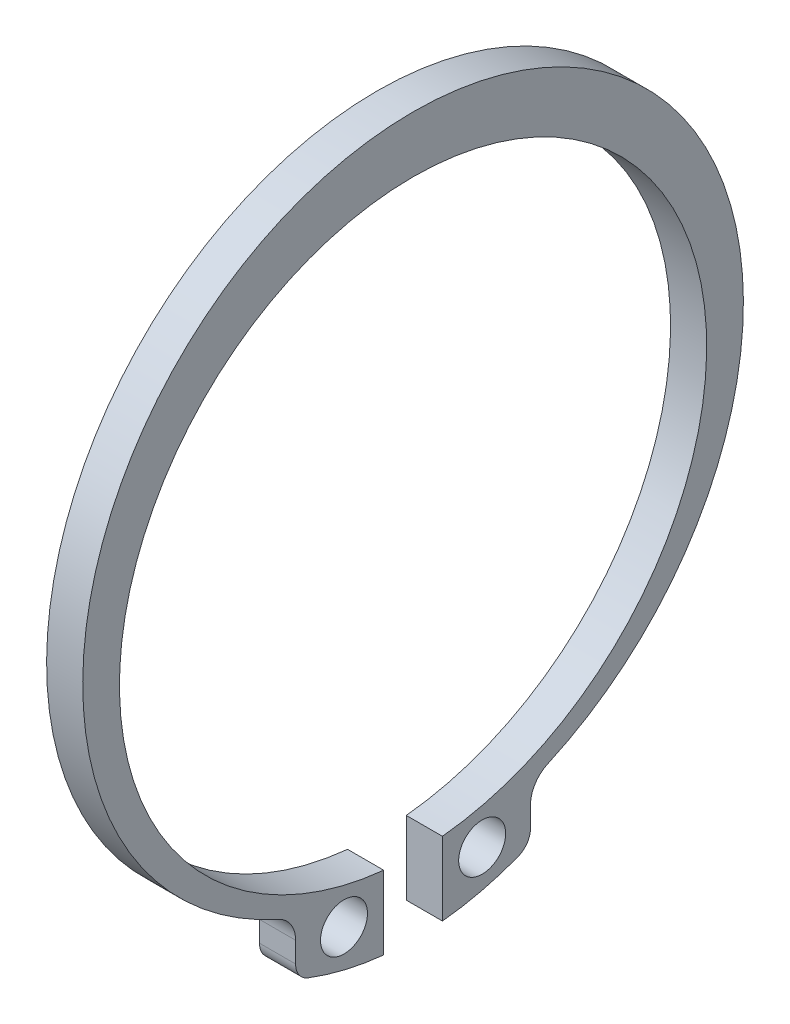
ISO-10303-21;
HEADER;
FILE_DESCRIPTION(('STEP AP214'),'2;1');
FILE_NAME('part.step','',(''),(''),'','','');
FILE_SCHEMA(('AUTOMOTIVE_DESIGN { 1 0 10303 214 1 1 1 1 }'));
ENDSEC;
DATA;
#1=APPLICATION_CONTEXT('core data for automotive mechanical design processes');
#2=APPLICATION_PROTOCOL_DEFINITION('international standard','automotive_design',2000,#1);
#3=PRODUCT_CONTEXT('',#1,'mechanical');
#4=PRODUCT('Part','Part','',(#3));
#5=PRODUCT_RELATED_PRODUCT_CATEGORY('part','',(#4));
#6=PRODUCT_DEFINITION_FORMATION('','',#4);
#7=PRODUCT_DEFINITION_CONTEXT('part definition',#1,'design');
#8=PRODUCT_DEFINITION('design','',#6,#7);
#9=PRODUCT_DEFINITION_SHAPE('','',#8);
#10=(LENGTH_UNIT() NAMED_UNIT(*) SI_UNIT(.MILLI.,.METRE.));
#11=(NAMED_UNIT(*) PLANE_ANGLE_UNIT() SI_UNIT($,.RADIAN.));
#12=(NAMED_UNIT(*) SI_UNIT($,.STERADIAN.) SOLID_ANGLE_UNIT());
#13=UNCERTAINTY_MEASURE_WITH_UNIT(LENGTH_MEASURE(1.E-05),#10,'distance_accuracy_value','');
#14=(GEOMETRIC_REPRESENTATION_CONTEXT(3) GLOBAL_UNCERTAINTY_ASSIGNED_CONTEXT((#13)) GLOBAL_UNIT_ASSIGNED_CONTEXT((#10,
#11,#12)) REPRESENTATION_CONTEXT('',''));
#15=CARTESIAN_POINT('',(0.,0.,0.));
#16=DIRECTION('',(0.,0.,1.));
#17=DIRECTION('',(1.,0.,0.));
#18=AXIS2_PLACEMENT_3D('',#15,#16,#17);
#19=CARTESIAN_POINT('',(0.,-10.2535562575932,-4.875));
#20=DIRECTION('',(1.,0.,0.));
#21=DIRECTION('',(0.,1.,0.));
#22=AXIS2_PLACEMENT_3D('',#19,#20,#21);
#23=PLANE('',#22);
#24=CARTESIAN_POINT('',(0.,-10.6709987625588,2.29411764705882));
#25=DIRECTION('',(1.,0.,0.));
#26=DIRECTION('',(0.,0.,-1.));
#27=AXIS2_PLACEMENT_3D('',#24,#25,#26);
#28=CIRCLE('',#27,0.78);
#29=CARTESIAN_POINT('',(0.,-10.6709987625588,1.51411764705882));
#30=VERTEX_POINT('',#29);
#31=EDGE_CURVE('E11',#30,#30,#28,.T.);
#32=ORIENTED_EDGE('',*,*,#31,.T.);
#33=EDGE_LOOP('',(#32));
#34=FACE_BOUND('',#33,.T.);
#35=CARTESIAN_POINT('',(0.,-10.2535562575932,-4.875));
#36=DIRECTION('',(1.,0.,0.));
#37=DIRECTION('',(0.,0.,-1.));
#38=AXIS2_PLACEMENT_3D('',#35,#36,#37);
#39=CIRCLE('',#38,0.975);
#40=CARTESIAN_POINT('',(0.,-9.36347003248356,-4.47704081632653));
#41=VERTEX_POINT('',#40);
#42=CARTESIAN_POINT('',(0.,-10.2535562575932,-3.9));
#43=VERTEX_POINT('',#42);
#44=EDGE_CURVE('E152',#41,#43,#39,.T.);
#45=ORIENTED_EDGE('',*,*,#44,.T.);
#46=DIRECTION('',(0.,1.,0.));
#47=VECTOR('',#46,1.);
#48=CARTESIAN_POINT('',(0.,-10.9373529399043,-3.9));
#49=LINE('',#48,#47);
#50=CARTESIAN_POINT('',(0.,-10.9373529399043,-3.9));
#51=VERTEX_POINT('',#50);
#52=EDGE_CURVE('E187',#51,#43,#49,.T.);
#53=ORIENTED_EDGE('',*,*,#52,.F.);
#54=CARTESIAN_POINT('',(0.,-10.9373529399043,-3.25));
#55=DIRECTION('',(1.,0.,0.));
#56=DIRECTION('',(0.,0.,-1.));
#57=AXIS2_PLACEMENT_3D('',#54,#55,#56);
#58=CIRCLE('',#57,0.65);
#59=CARTESIAN_POINT('',(0.,-11.5444852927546,-3.48214285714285));
#60=VERTEX_POINT('',#59);
#61=EDGE_CURVE('E206',#60,#51,#58,.T.);
#62=ORIENTED_EDGE('',*,*,#61,.F.);
#63=CARTESIAN_POINT('',(0.,-2.43749999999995,0.));
#64=DIRECTION('',(1.,0.,0.));
#65=DIRECTION('',(0.,0.,-1.));
#66=AXIS2_PLACEMENT_3D('',#63,#64,#65);
#67=CIRCLE('',#66,9.75);
#68=CARTESIAN_POINT('',(0.,-12.1386275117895,-0.975));
#69=VERTEX_POINT('',#68);
#70=EDGE_CURVE('E202',#69,#60,#67,.T.);
#71=ORIENTED_EDGE('',*,*,#70,.F.);
#72=DIRECTION('',(0.,-1.,0.));
#73=VECTOR('',#72,1.);
#74=CARTESIAN_POINT('',(0.,-9.70112751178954,-0.975));
#75=LINE('',#74,#73);
#76=CARTESIAN_POINT('',(0.,-9.70112751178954,-0.975));
#77=VERTEX_POINT('',#76);
#78=EDGE_CURVE('E227',#77,#69,#75,.T.);
#79=ORIENTED_EDGE('',*,*,#78,.F.);
#80=CARTESIAN_POINT('',(0.,0.,0.));
#81=DIRECTION('',(1.,0.,0.));
#82=DIRECTION('',(0.,0.,-1.));
#83=AXIS2_PLACEMENT_3D('',#80,#81,#82);
#84=CIRCLE('',#83,9.75);
#85=CARTESIAN_POINT('',(0.,-9.70112751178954,0.975));
#86=VERTEX_POINT('',#85);
#87=EDGE_CURVE('E188',#77,#86,#84,.T.);
#88=ORIENTED_EDGE('',*,*,#87,.T.);
#89=DIRECTION('',(0.,1.,0.));
#90=VECTOR('',#89,1.);
#91=CARTESIAN_POINT('',(0.,-12.1386275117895,0.975));
#92=LINE('',#91,#90);
#93=CARTESIAN_POINT('',(0.,-12.1386275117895,0.975));
#94=VERTEX_POINT('',#93);
#95=EDGE_CURVE('E243',#94,#86,#92,.T.);
#96=ORIENTED_EDGE('',*,*,#95,.F.);
#97=CARTESIAN_POINT('',(0.,-2.4375,0.));
#98=DIRECTION('',(1.,0.,0.));
#99=DIRECTION('',(0.,0.,-1.));
#100=AXIS2_PLACEMENT_3D('',#97,#98,#99);
#101=CIRCLE('',#100,9.75);
#102=CARTESIAN_POINT('',(0.,-11.5444852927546,3.48214285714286));
#103=VERTEX_POINT('',#102);
#104=EDGE_CURVE('E211',#103,#94,#101,.T.);
#105=ORIENTED_EDGE('',*,*,#104,.F.);
#106=CARTESIAN_POINT('',(0.,-10.9373529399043,3.25));
#107=DIRECTION('',(1.,0.,0.));
#108=DIRECTION('',(0.,0.,-1.));
#109=AXIS2_PLACEMENT_3D('',#106,#107,#108);
#110=CIRCLE('',#109,0.65);
#111=CARTESIAN_POINT('',(0.,-10.9373529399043,3.9));
#112=VERTEX_POINT('',#111);
#113=EDGE_CURVE('E257',#112,#103,#110,.T.);
#114=ORIENTED_EDGE('',*,*,#113,.F.);
#115=DIRECTION('',(0.,-1.,0.));
#116=VECTOR('',#115,1.);
#117=CARTESIAN_POINT('',(0.,-10.2535562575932,3.9));
#118=LINE('',#117,#116);
#119=CARTESIAN_POINT('',(0.,-10.2535562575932,3.9));
#120=VERTEX_POINT('',#119);
#121=EDGE_CURVE('E267',#120,#112,#118,.T.);
#122=ORIENTED_EDGE('',*,*,#121,.F.);
#123=CARTESIAN_POINT('',(0.,-10.2535562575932,4.875));
#124=DIRECTION('',(1.,0.,0.));
#125=DIRECTION('',(0.,0.,-1.));
#126=AXIS2_PLACEMENT_3D('',#123,#124,#125);
#127=CIRCLE('',#126,0.975);
#128=CARTESIAN_POINT('',(0.,-9.36347003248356,4.47704081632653));
#129=VERTEX_POINT('',#128);
#130=EDGE_CURVE('E154',#120,#129,#127,.T.);
#131=ORIENTED_EDGE('',*,*,#130,.T.);
#132=CARTESIAN_POINT('',(0.,0.65,0.));
#133=DIRECTION('',(1.,0.,0.));
#134=DIRECTION('',(0.,0.,-1.));
#135=AXIS2_PLACEMENT_3D('',#132,#133,#134);
#136=CIRCLE('',#135,10.96875);
#137=EDGE_CURVE('E147',#41,#129,#136,.T.);
#138=ORIENTED_EDGE('',*,*,#137,.F.);
#139=EDGE_LOOP('',(#45,#53,#62,#71,#79,#88,#96,#105,#114,#122,#131,#138));
#140=FACE_BOUND('',#139,.T.);
#141=CARTESIAN_POINT('',(0.,-10.6709987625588,-2.29411764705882));
#142=DIRECTION('',(1.,0.,0.));
#143=DIRECTION('',(0.,0.,-1.));
#144=AXIS2_PLACEMENT_3D('',#141,#142,#143);
#145=CIRCLE('',#144,0.78);
#146=CARTESIAN_POINT('',(0.,-10.6709987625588,-3.07411764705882));
#147=VERTEX_POINT('',#146);
#148=EDGE_CURVE('E287',#147,#147,#145,.T.);
#149=ORIENTED_EDGE('',*,*,#148,.T.);
#150=EDGE_LOOP('',(#149));
#151=FACE_BOUND('',#150,.T.);
#152=ADVANCED_FACE('F17',(#34,#140,#151),#23,.F.);
#153=CARTESIAN_POINT('',(1.2,-10.2535562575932,-4.875));
#154=DIRECTION('',(1.,0.,0.));
#155=DIRECTION('',(0.,1.,0.));
#156=AXIS2_PLACEMENT_3D('',#153,#154,#155);
#157=PLANE('',#156);
#158=CARTESIAN_POINT('',(1.2,-10.6709987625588,2.29411764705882));
#159=DIRECTION('',(1.,0.,0.));
#160=DIRECTION('',(0.,0.,-1.));
#161=AXIS2_PLACEMENT_3D('',#158,#159,#160);
#162=CIRCLE('',#161,0.78);
#163=CARTESIAN_POINT('',(1.2,-10.6709987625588,1.51411764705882));
#164=VERTEX_POINT('',#163);
#165=EDGE_CURVE('E25',#164,#164,#162,.T.);
#166=ORIENTED_EDGE('',*,*,#165,.F.);
#167=EDGE_LOOP('',(#166));
#168=FACE_BOUND('',#167,.T.);
#169=CARTESIAN_POINT('',(1.2,-10.2535562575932,-4.875));
#170=DIRECTION('',(1.,0.,0.));
#171=DIRECTION('',(0.,0.,-1.));
#172=AXIS2_PLACEMENT_3D('',#169,#170,#171);
#173=CIRCLE('',#172,0.975);
#174=CARTESIAN_POINT('',(1.2,-9.36347003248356,-4.47704081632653));
#175=VERTEX_POINT('',#174);
#176=CARTESIAN_POINT('',(1.2,-10.2535562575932,-3.9));
#177=VERTEX_POINT('',#176);
#178=EDGE_CURVE('E169',#175,#177,#173,.T.);
#179=ORIENTED_EDGE('',*,*,#178,.F.);
#180=CARTESIAN_POINT('',(1.2,0.65,0.));
#181=DIRECTION('',(1.,0.,0.));
#182=DIRECTION('',(0.,0.,-1.));
#183=AXIS2_PLACEMENT_3D('',#180,#181,#182);
#184=CIRCLE('',#183,10.96875);
#185=CARTESIAN_POINT('',(1.2,-9.36347003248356,4.47704081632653));
#186=VERTEX_POINT('',#185);
#187=EDGE_CURVE('E159',#175,#186,#184,.T.);
#188=ORIENTED_EDGE('',*,*,#187,.T.);
#189=CARTESIAN_POINT('',(1.2,-10.2535562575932,4.875));
#190=DIRECTION('',(1.,0.,0.));
#191=DIRECTION('',(0.,0.,-1.));
#192=AXIS2_PLACEMENT_3D('',#189,#190,#191);
#193=CIRCLE('',#192,0.975);
#194=CARTESIAN_POINT('',(1.2,-10.2535562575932,3.9));
#195=VERTEX_POINT('',#194);
#196=EDGE_CURVE('E223',#195,#186,#193,.T.);
#197=ORIENTED_EDGE('',*,*,#196,.F.);
#198=DIRECTION('',(0.,-1.,0.));
#199=VECTOR('',#198,1.);
#200=CARTESIAN_POINT('',(1.2,-10.2535562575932,3.9));
#201=LINE('',#200,#199);
#202=CARTESIAN_POINT('',(1.2,-10.9373529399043,3.9));
#203=VERTEX_POINT('',#202);
#204=EDGE_CURVE('E270',#195,#203,#201,.T.);
#205=ORIENTED_EDGE('',*,*,#204,.T.);
#206=CARTESIAN_POINT('',(1.2,-10.9373529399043,3.25));
#207=DIRECTION('',(1.,0.,0.));
#208=DIRECTION('',(0.,0.,-1.));
#209=AXIS2_PLACEMENT_3D('',#206,#207,#208);
#210=CIRCLE('',#209,0.65);
#211=CARTESIAN_POINT('',(1.2,-11.5444852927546,3.48214285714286));
#212=VERTEX_POINT('',#211);
#213=EDGE_CURVE('E260',#203,#212,#210,.T.);
#214=ORIENTED_EDGE('',*,*,#213,.T.);
#215=CARTESIAN_POINT('',(1.2,-2.4375,0.));
#216=DIRECTION('',(1.,0.,0.));
#217=DIRECTION('',(0.,0.,-1.));
#218=AXIS2_PLACEMENT_3D('',#215,#216,#217);
#219=CIRCLE('',#218,9.75);
#220=CARTESIAN_POINT('',(1.2,-12.1386275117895,0.975));
#221=VERTEX_POINT('',#220);
#222=EDGE_CURVE('E250',#212,#221,#219,.T.);
#223=ORIENTED_EDGE('',*,*,#222,.T.);
#224=DIRECTION('',(0.,1.,0.));
#225=VECTOR('',#224,1.);
#226=CARTESIAN_POINT('',(1.2,-12.1386275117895,0.975));
#227=LINE('',#226,#225);
#228=CARTESIAN_POINT('',(1.2,-9.70112751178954,0.975));
#229=VERTEX_POINT('',#228);
#230=EDGE_CURVE('E212',#221,#229,#227,.T.);
#231=ORIENTED_EDGE('',*,*,#230,.T.);
#232=CARTESIAN_POINT('',(1.2,0.,0.));
#233=DIRECTION('',(1.,0.,0.));
#234=DIRECTION('',(0.,0.,-1.));
#235=AXIS2_PLACEMENT_3D('',#232,#233,#234);
#236=CIRCLE('',#235,9.75);
#237=CARTESIAN_POINT('',(1.2,-9.70112751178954,-0.975));
#238=VERTEX_POINT('',#237);
#239=EDGE_CURVE('E192',#238,#229,#236,.T.);
#240=ORIENTED_EDGE('',*,*,#239,.F.);
#241=DIRECTION('',(0.,-1.,0.));
#242=VECTOR('',#241,1.);
#243=CARTESIAN_POINT('',(1.2,-9.70112751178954,-0.975));
#244=LINE('',#243,#242);
#245=CARTESIAN_POINT('',(1.2,-12.1386275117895,-0.975));
#246=VERTEX_POINT('',#245);
#247=EDGE_CURVE('E230',#238,#246,#244,.T.);
#248=ORIENTED_EDGE('',*,*,#247,.T.);
#249=CARTESIAN_POINT('',(1.2,-2.43749999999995,0.));
#250=DIRECTION('',(1.,0.,0.));
#251=DIRECTION('',(0.,0.,-1.));
#252=AXIS2_PLACEMENT_3D('',#249,#250,#251);
#253=CIRCLE('',#252,9.75);
#254=CARTESIAN_POINT('',(1.2,-11.5444852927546,-3.48214285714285));
#255=VERTEX_POINT('',#254);
#256=EDGE_CURVE('E198',#246,#255,#253,.T.);
#257=ORIENTED_EDGE('',*,*,#256,.T.);
#258=CARTESIAN_POINT('',(1.2,-10.9373529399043,-3.25));
#259=DIRECTION('',(1.,0.,0.));
#260=DIRECTION('',(0.,0.,-1.));
#261=AXIS2_PLACEMENT_3D('',#258,#259,#260);
#262=CIRCLE('',#261,0.65);
#263=CARTESIAN_POINT('',(1.2,-10.9373529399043,-3.9));
#264=VERTEX_POINT('',#263);
#265=EDGE_CURVE('E180',#255,#264,#262,.T.);
#266=ORIENTED_EDGE('',*,*,#265,.T.);
#267=DIRECTION('',(0.,1.,0.));
#268=VECTOR('',#267,1.);
#269=CARTESIAN_POINT('',(1.2,-10.9373529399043,-3.9));
#270=LINE('',#269,#268);
#271=EDGE_CURVE('E194',#264,#177,#270,.T.);
#272=ORIENTED_EDGE('',*,*,#271,.T.);
#273=EDGE_LOOP('',(#179,#188,#197,#205,#214,#223,#231,#240,#248,#257,#266,#272));
#274=FACE_BOUND('',#273,.T.);
#275=CARTESIAN_POINT('',(1.2,-10.6709987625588,-2.29411764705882));
#276=DIRECTION('',(1.,0.,0.));
#277=DIRECTION('',(0.,0.,-1.));
#278=AXIS2_PLACEMENT_3D('',#275,#276,#277);
#279=CIRCLE('',#278,0.78);
#280=CARTESIAN_POINT('',(1.2,-10.6709987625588,-3.07411764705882));
#281=VERTEX_POINT('',#280);
#282=EDGE_CURVE('E284',#281,#281,#279,.T.);
#283=ORIENTED_EDGE('',*,*,#282,.F.);
#284=EDGE_LOOP('',(#283));
#285=FACE_BOUND('',#284,.T.);
#286=ADVANCED_FACE('F418',(#168,#274,#285),#157,.T.);
#287=CARTESIAN_POINT('',(1.2,-10.6709987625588,2.29411764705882));
#288=DIRECTION('',(-1.,0.,0.));
#289=DIRECTION('',(0.,0.,1.));
#290=AXIS2_PLACEMENT_3D('',#287,#288,#289);
#291=CYLINDRICAL_SURFACE('',#290,0.78);
#292=ORIENTED_EDGE('',*,*,#31,.F.);
#293=EDGE_LOOP('',(#292));
#294=FACE_BOUND('',#293,.T.);
#295=ORIENTED_EDGE('',*,*,#165,.T.);
#296=EDGE_LOOP('',(#295));
#297=FACE_BOUND('',#296,.T.);
#298=ADVANCED_FACE('F421',(#294,#297),#291,.F.);
#299=CARTESIAN_POINT('',(1.2,-10.6709987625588,-2.29411764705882));
#300=DIRECTION('',(-1.,0.,0.));
#301=DIRECTION('',(0.,0.,1.));
#302=AXIS2_PLACEMENT_3D('',#299,#300,#301);
#303=CYLINDRICAL_SURFACE('',#302,0.78);
#304=ORIENTED_EDGE('',*,*,#148,.F.);
#305=EDGE_LOOP('',(#304));
#306=FACE_BOUND('',#305,.T.);
#307=ORIENTED_EDGE('',*,*,#282,.T.);
#308=EDGE_LOOP('',(#307));
#309=FACE_BOUND('',#308,.T.);
#310=ADVANCED_FACE('F425',(#306,#309),#303,.F.);
#311=CARTESIAN_POINT('',(1.2,0.65,0.));
#312=DIRECTION('',(-1.,0.,0.));
#313=DIRECTION('',(0.,0.,1.));
#314=AXIS2_PLACEMENT_3D('',#311,#312,#313);
#315=CYLINDRICAL_SURFACE('',#314,10.96875);
#316=ORIENTED_EDGE('',*,*,#137,.T.);
#317=DIRECTION('',(-1.,0.,0.));
#318=VECTOR('',#317,1.);
#319=CARTESIAN_POINT('',(1.2,-9.36347003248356,4.47704081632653));
#320=LINE('',#319,#318);
#321=EDGE_CURVE('E160',#186,#129,#320,.T.);
#322=ORIENTED_EDGE('',*,*,#321,.F.);
#323=ORIENTED_EDGE('',*,*,#187,.F.);
#324=DIRECTION('',(-1.,0.,0.));
#325=VECTOR('',#324,1.);
#326=CARTESIAN_POINT('',(1.2,-9.36347003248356,-4.47704081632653));
#327=LINE('',#326,#325);
#328=EDGE_CURVE('E163',#175,#41,#327,.T.);
#329=ORIENTED_EDGE('',*,*,#328,.T.);
#330=EDGE_LOOP('',(#316,#322,#323,#329));
#331=FACE_BOUND('',#330,.T.);
#332=ADVANCED_FACE('F164',(#331),#315,.T.);
#333=CARTESIAN_POINT('',(1.2,-10.2535562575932,4.875));
#334=DIRECTION('',(-1.,0.,0.));
#335=DIRECTION('',(0.,0.,1.));
#336=AXIS2_PLACEMENT_3D('',#333,#334,#335);
#337=CYLINDRICAL_SURFACE('',#336,0.975);
#338=ORIENTED_EDGE('',*,*,#130,.F.);
#339=DIRECTION('',(-1.,0.,0.));
#340=VECTOR('',#339,1.);
#341=CARTESIAN_POINT('',(1.2,-10.2535562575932,3.9));
#342=LINE('',#341,#340);
#343=EDGE_CURVE('E273',#195,#120,#342,.T.);
#344=ORIENTED_EDGE('',*,*,#343,.F.);
#345=ORIENTED_EDGE('',*,*,#196,.T.);
#346=ORIENTED_EDGE('',*,*,#321,.T.);
#347=EDGE_LOOP('',(#338,#344,#345,#346));
#348=FACE_BOUND('',#347,.T.);
#349=ADVANCED_FACE('F416',(#348),#337,.F.);
#350=CARTESIAN_POINT('',(1.2,-10.2535562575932,3.9));
#351=DIRECTION('',(0.,0.,-1.));
#352=DIRECTION('',(0.,-1.,0.));
#353=AXIS2_PLACEMENT_3D('',#350,#351,#352);
#354=PLANE('',#353);
#355=ORIENTED_EDGE('',*,*,#121,.T.);
#356=DIRECTION('',(-1.,0.,0.));
#357=VECTOR('',#356,1.);
#358=CARTESIAN_POINT('',(1.2,-10.9373529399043,3.9));
#359=LINE('',#358,#357);
#360=EDGE_CURVE('E263',#203,#112,#359,.T.);
#361=ORIENTED_EDGE('',*,*,#360,.F.);
#362=ORIENTED_EDGE('',*,*,#204,.F.);
#363=ORIENTED_EDGE('',*,*,#343,.T.);
#364=EDGE_LOOP('',(#355,#361,#362,#363));
#365=FACE_BOUND('',#364,.T.);
#366=ADVANCED_FACE('F413',(#365),#354,.F.);
#367=CARTESIAN_POINT('',(1.2,-10.9373529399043,3.25));
#368=DIRECTION('',(-1.,0.,0.));
#369=DIRECTION('',(0.,0.,1.));
#370=AXIS2_PLACEMENT_3D('',#367,#368,#369);
#371=CYLINDRICAL_SURFACE('',#370,0.65);
#372=ORIENTED_EDGE('',*,*,#113,.T.);
#373=DIRECTION('',(-1.,0.,0.));
#374=VECTOR('',#373,1.);
#375=CARTESIAN_POINT('',(1.2,-11.5444852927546,3.48214285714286));
#376=LINE('',#375,#374);
#377=EDGE_CURVE('E253',#212,#103,#376,.T.);
#378=ORIENTED_EDGE('',*,*,#377,.F.);
#379=ORIENTED_EDGE('',*,*,#213,.F.);
#380=ORIENTED_EDGE('',*,*,#360,.T.);
#381=EDGE_LOOP('',(#372,#378,#379,#380));
#382=FACE_BOUND('',#381,.T.);
#383=ADVANCED_FACE('F408',(#382),#371,.T.);
#384=CARTESIAN_POINT('',(1.2,-2.4375,0.));
#385=DIRECTION('',(-1.,0.,0.));
#386=DIRECTION('',(0.,0.,1.));
#387=AXIS2_PLACEMENT_3D('',#384,#385,#386);
#388=CYLINDRICAL_SURFACE('',#387,9.75);
#389=ORIENTED_EDGE('',*,*,#104,.T.);
#390=DIRECTION('',(-1.,0.,0.));
#391=VECTOR('',#390,1.);
#392=CARTESIAN_POINT('',(1.2,-12.1386275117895,0.975));
#393=LINE('',#392,#391);
#394=EDGE_CURVE('E207',#221,#94,#393,.T.);
#395=ORIENTED_EDGE('',*,*,#394,.F.);
#396=ORIENTED_EDGE('',*,*,#222,.F.);
#397=ORIENTED_EDGE('',*,*,#377,.T.);
#398=EDGE_LOOP('',(#389,#395,#396,#397));
#399=FACE_BOUND('',#398,.T.);
#400=ADVANCED_FACE('F404',(#399),#388,.T.);
#401=CARTESIAN_POINT('',(1.2,-12.1386275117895,0.975));
#402=DIRECTION('',(0.,0.,1.));
#403=DIRECTION('',(1.,0.,0.));
#404=AXIS2_PLACEMENT_3D('',#401,#402,#403);
#405=PLANE('',#404);
#406=ORIENTED_EDGE('',*,*,#95,.T.);
#407=DIRECTION('',(-1.,0.,0.));
#408=VECTOR('',#407,1.);
#409=CARTESIAN_POINT('',(1.2,-9.70112751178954,0.975));
#410=LINE('',#409,#408);
#411=EDGE_CURVE('E238',#229,#86,#410,.T.);
#412=ORIENTED_EDGE('',*,*,#411,.F.);
#413=ORIENTED_EDGE('',*,*,#230,.F.);
#414=ORIENTED_EDGE('',*,*,#394,.T.);
#415=EDGE_LOOP('',(#406,#412,#413,#414));
#416=FACE_BOUND('',#415,.T.);
#417=ADVANCED_FACE('F400',(#416),#405,.F.);
#418=CARTESIAN_POINT('',(1.2,0.,0.));
#419=DIRECTION('',(-1.,0.,0.));
#420=DIRECTION('',(0.,0.,1.));
#421=AXIS2_PLACEMENT_3D('',#418,#419,#420);
#422=CYLINDRICAL_SURFACE('',#421,9.75);
#423=ORIENTED_EDGE('',*,*,#87,.F.);
#424=DIRECTION('',(-1.,0.,0.));
#425=VECTOR('',#424,1.);
#426=CARTESIAN_POINT('',(1.2,-9.70112751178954,-0.975));
#427=LINE('',#426,#425);
#428=EDGE_CURVE('E193',#238,#77,#427,.T.);
#429=ORIENTED_EDGE('',*,*,#428,.F.);
#430=ORIENTED_EDGE('',*,*,#239,.T.);
#431=ORIENTED_EDGE('',*,*,#411,.T.);
#432=EDGE_LOOP('',(#423,#429,#430,#431));
#433=FACE_BOUND('',#432,.T.);
#434=ADVANCED_FACE('F396',(#433),#422,.F.);
#435=CARTESIAN_POINT('',(1.2,-9.70112751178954,-0.975));
#436=DIRECTION('',(0.,0.,-1.));
#437=DIRECTION('',(0.,-1.,0.));
#438=AXIS2_PLACEMENT_3D('',#435,#436,#437);
#439=PLANE('',#438);
#440=ORIENTED_EDGE('',*,*,#78,.T.);
#441=DIRECTION('',(-1.,0.,0.));
#442=VECTOR('',#441,1.);
#443=CARTESIAN_POINT('',(1.2,-12.1386275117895,-0.975));
#444=LINE('',#443,#442);
#445=EDGE_CURVE('E201',#246,#69,#444,.T.);
#446=ORIENTED_EDGE('',*,*,#445,.F.);
#447=ORIENTED_EDGE('',*,*,#247,.F.);
#448=ORIENTED_EDGE('',*,*,#428,.T.);
#449=EDGE_LOOP('',(#440,#446,#447,#448));
#450=FACE_BOUND('',#449,.T.);
#451=ADVANCED_FACE('F391',(#450),#439,.F.);
#452=CARTESIAN_POINT('',(1.2,-2.43749999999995,0.));
#453=DIRECTION('',(-1.,0.,0.));
#454=DIRECTION('',(0.,0.,1.));
#455=AXIS2_PLACEMENT_3D('',#452,#453,#454);
#456=CYLINDRICAL_SURFACE('',#455,9.75);
#457=ORIENTED_EDGE('',*,*,#70,.T.);
#458=DIRECTION('',(-1.,0.,0.));
#459=VECTOR('',#458,1.);
#460=CARTESIAN_POINT('',(1.2,-11.5444852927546,-3.48214285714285));
#461=LINE('',#460,#459);
#462=EDGE_CURVE('E215',#255,#60,#461,.T.);
#463=ORIENTED_EDGE('',*,*,#462,.F.);
#464=ORIENTED_EDGE('',*,*,#256,.F.);
#465=ORIENTED_EDGE('',*,*,#445,.T.);
#466=EDGE_LOOP('',(#457,#463,#464,#465));
#467=FACE_BOUND('',#466,.T.);
#468=ADVANCED_FACE('F387',(#467),#456,.T.);
#469=CARTESIAN_POINT('',(1.2,-10.9373529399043,-3.25));
#470=DIRECTION('',(-1.,0.,0.));
#471=DIRECTION('',(0.,0.,1.));
#472=AXIS2_PLACEMENT_3D('',#469,#470,#471);
#473=CYLINDRICAL_SURFACE('',#472,0.65);
#474=ORIENTED_EDGE('',*,*,#61,.T.);
#475=DIRECTION('',(-1.,0.,0.));
#476=VECTOR('',#475,1.);
#477=CARTESIAN_POINT('',(1.2,-10.9373529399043,-3.9));
#478=LINE('',#477,#476);
#479=EDGE_CURVE('E197',#264,#51,#478,.T.);
#480=ORIENTED_EDGE('',*,*,#479,.F.);
#481=ORIENTED_EDGE('',*,*,#265,.F.);
#482=ORIENTED_EDGE('',*,*,#462,.T.);
#483=EDGE_LOOP('',(#474,#480,#481,#482));
#484=FACE_BOUND('',#483,.T.);
#485=ADVANCED_FACE('F382',(#484),#473,.T.);
#486=CARTESIAN_POINT('',(1.2,-10.9373529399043,-3.9));
#487=DIRECTION('',(0.,0.,1.));
#488=DIRECTION('',(1.,0.,0.));
#489=AXIS2_PLACEMENT_3D('',#486,#487,#488);
#490=PLANE('',#489);
#491=ORIENTED_EDGE('',*,*,#52,.T.);
#492=DIRECTION('',(-1.,0.,0.));
#493=VECTOR('',#492,1.);
#494=CARTESIAN_POINT('',(1.2,-10.2535562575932,-3.9));
#495=LINE('',#494,#493);
#496=EDGE_CURVE('E174',#177,#43,#495,.T.);
#497=ORIENTED_EDGE('',*,*,#496,.F.);
#498=ORIENTED_EDGE('',*,*,#271,.F.);
#499=ORIENTED_EDGE('',*,*,#479,.T.);
#500=EDGE_LOOP('',(#491,#497,#498,#499));
#501=FACE_BOUND('',#500,.T.);
#502=ADVANCED_FACE('F375',(#501),#490,.F.);
#503=CARTESIAN_POINT('',(1.2,-10.2535562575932,-4.875));
#504=DIRECTION('',(-1.,0.,0.));
#505=DIRECTION('',(0.,0.,1.));
#506=AXIS2_PLACEMENT_3D('',#503,#504,#505);
#507=CYLINDRICAL_SURFACE('',#506,0.975);
#508=ORIENTED_EDGE('',*,*,#44,.F.);
#509=ORIENTED_EDGE('',*,*,#328,.F.);
#510=ORIENTED_EDGE('',*,*,#178,.T.);
#511=ORIENTED_EDGE('',*,*,#496,.T.);
#512=EDGE_LOOP('',(#508,#509,#510,#511));
#513=FACE_BOUND('',#512,.T.);
#514=ADVANCED_FACE('F172',(#513),#507,.F.);
#515=CLOSED_SHELL('',(#152,#286,#298,#310,#332,#349,#366,#383,#400,#417,#434,#451,#468,#485,
#502,#514));
#516=MANIFOLD_SOLID_BREP('B1',#515);
#517=ADVANCED_BREP_SHAPE_REPRESENTATION('',(#18,#516),#14);
#518=SHAPE_DEFINITION_REPRESENTATION(#9,#517);
ENDSEC;
END-ISO-10303-21;
